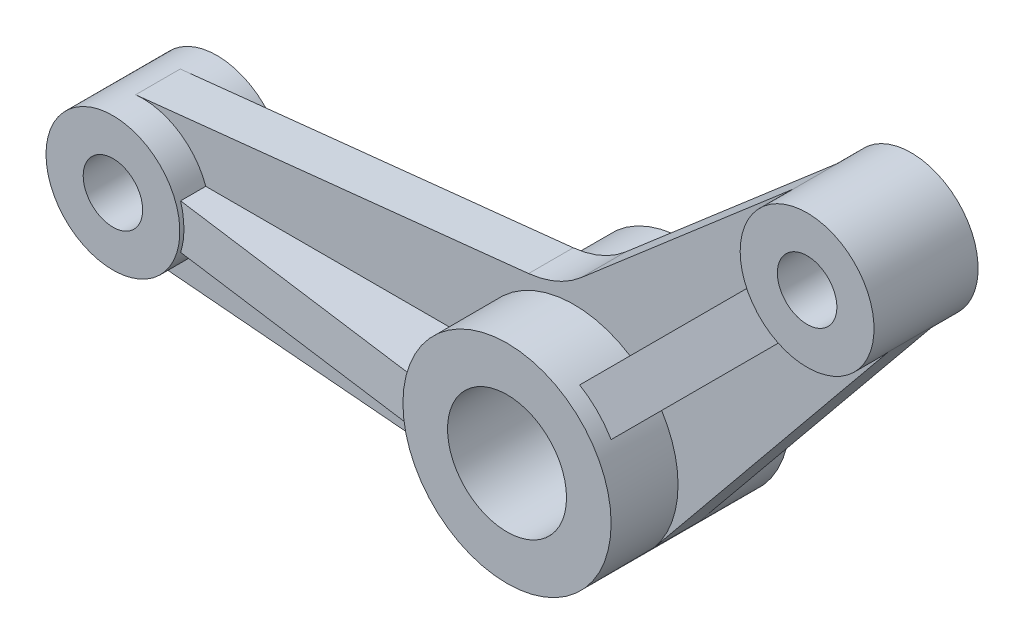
ISO-10303-21;
HEADER;
FILE_DESCRIPTION(('STEP AP214'),'2;1');
FILE_NAME('part.step','',(''),(''),'','','');
FILE_SCHEMA(('AUTOMOTIVE_DESIGN { 1 0 10303 214 1 1 1 1 }'));
ENDSEC;
DATA;
#1=APPLICATION_CONTEXT('core data for automotive mechanical design processes');
#2=APPLICATION_PROTOCOL_DEFINITION('international standard','automotive_design',2000,#1);
#3=PRODUCT_CONTEXT('',#1,'mechanical');
#4=PRODUCT('Part','Part','',(#3));
#5=PRODUCT_RELATED_PRODUCT_CATEGORY('part','',(#4));
#6=PRODUCT_DEFINITION_FORMATION('','',#4);
#7=PRODUCT_DEFINITION_CONTEXT('part definition',#1,'design');
#8=PRODUCT_DEFINITION('design','',#6,#7);
#9=PRODUCT_DEFINITION_SHAPE('','',#8);
#10=(LENGTH_UNIT() NAMED_UNIT(*) SI_UNIT(.MILLI.,.METRE.));
#11=(NAMED_UNIT(*) PLANE_ANGLE_UNIT() SI_UNIT($,.RADIAN.));
#12=(NAMED_UNIT(*) SI_UNIT($,.STERADIAN.) SOLID_ANGLE_UNIT());
#13=UNCERTAINTY_MEASURE_WITH_UNIT(LENGTH_MEASURE(1.E-05),#10,'distance_accuracy_value','');
#14=(GEOMETRIC_REPRESENTATION_CONTEXT(3) GLOBAL_UNCERTAINTY_ASSIGNED_CONTEXT((#13)) GLOBAL_UNIT_ASSIGNED_CONTEXT((#10,
#11,#12)) REPRESENTATION_CONTEXT('',''));
#15=CARTESIAN_POINT('',(0.,0.,0.));
#16=DIRECTION('',(0.,0.,1.));
#17=DIRECTION('',(1.,0.,0.));
#18=AXIS2_PLACEMENT_3D('',#15,#16,#17);
#19=CARTESIAN_POINT('',(-29.,0.,-1.5));
#20=DIRECTION('',(0.,0.,1.));
#21=DIRECTION('',(1.,0.,0.));
#22=AXIS2_PLACEMENT_3D('',#19,#20,#21);
#23=PLANE('',#22);
#24=DIRECTION('',(-0.707106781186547,-0.707106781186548,0.));
#25=VECTOR('',#24,1.);
#26=CARTESIAN_POINT('',(-13.4393398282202,-15.5606601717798,-1.5));
#27=LINE('',#26,#25);
#28=CARTESIAN_POINT('',(15.7383297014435,13.6170093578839,-1.5));
#29=VERTEX_POINT('',#28);
#30=CARTESIAN_POINT('',(5.89543007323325,3.77410972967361,-1.5));
#31=VERTEX_POINT('',#30);
#32=EDGE_CURVE('E210',#29,#31,#27,.T.);
#33=ORIENTED_EDGE('',*,*,#32,.F.);
#34=CARTESIAN_POINT('',(17.6776695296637,17.6776695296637,-1.5));
#35=DIRECTION('',(0.,0.,-1.));
#36=DIRECTION('',(1.,0.,0.));
#37=AXIS2_PLACEMENT_3D('',#34,#35,#36);
#38=CIRCLE('',#37,4.5);
#39=CARTESIAN_POINT('',(21.1618982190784,14.8298369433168,-1.5));
#40=VERTEX_POINT('',#39);
#41=EDGE_CURVE('E323',#40,#29,#38,.T.);
#42=ORIENTED_EDGE('',*,*,#41,.F.);
#43=DIRECTION('',(0.63285168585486,0.774273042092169,0.));
#44=VECTOR('',#43,1.);
#45=CARTESIAN_POINT('',(5.41991129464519,-4.42996180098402,-1.5));
#46=LINE('',#45,#44);
#47=CARTESIAN_POINT('',(5.41991129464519,-4.42996180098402,-1.5));
#48=VERTEX_POINT('',#47);
#49=EDGE_CURVE('E318',#48,#40,#46,.T.);
#50=ORIENTED_EDGE('',*,*,#49,.F.);
#51=CARTESIAN_POINT('',(0.,0.,-1.5));
#52=DIRECTION('',(0.,0.,-1.));
#53=DIRECTION('',(1.,0.,0.));
#54=AXIS2_PLACEMENT_3D('',#51,#52,#53);
#55=CIRCLE('',#54,7.);
#56=EDGE_CURVE('E315',#31,#48,#55,.T.);
#57=ORIENTED_EDGE('',*,*,#56,.F.);
#58=EDGE_LOOP('',(#33,#42,#50,#57));
#59=FACE_BOUND('',#58,.T.);
#60=ADVANCED_FACE('F31',(#59),#23,.F.);
#61=CARTESIAN_POINT('',(-29.,0.,1.5));
#62=DIRECTION('',(0.,0.,1.));
#63=DIRECTION('',(1.,0.,0.));
#64=AXIS2_PLACEMENT_3D('',#61,#62,#63);
#65=PLANE('',#64);
#66=CARTESIAN_POINT('',(17.6776695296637,17.6776695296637,1.5));
#67=DIRECTION('',(0.,0.,-1.));
#68=DIRECTION('',(1.,0.,0.));
#69=AXIS2_PLACEMENT_3D('',#66,#67,#68);
#70=CIRCLE('',#69,4.5);
#71=CARTESIAN_POINT('',(21.1618982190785,14.8298369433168,1.5));
#72=VERTEX_POINT('',#71);
#73=CARTESIAN_POINT('',(15.7383297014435,13.6170093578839,1.5));
#74=VERTEX_POINT('',#73);
#75=EDGE_CURVE('E348',#72,#74,#70,.T.);
#76=ORIENTED_EDGE('',*,*,#75,.T.);
#77=DIRECTION('',(-0.707106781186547,-0.707106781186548,0.));
#78=VECTOR('',#77,1.);
#79=CARTESIAN_POINT('',(-13.4393398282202,-15.5606601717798,1.5));
#80=LINE('',#79,#78);
#81=CARTESIAN_POINT('',(5.89543007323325,3.77410972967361,1.5));
#82=VERTEX_POINT('',#81);
#83=EDGE_CURVE('E233',#74,#82,#80,.T.);
#84=ORIENTED_EDGE('',*,*,#83,.T.);
#85=CARTESIAN_POINT('',(0.,0.,1.5));
#86=DIRECTION('',(0.,0.,-1.));
#87=DIRECTION('',(1.,0.,0.));
#88=AXIS2_PLACEMENT_3D('',#85,#86,#87);
#89=CIRCLE('',#88,7.);
#90=CARTESIAN_POINT('',(5.41991129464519,-4.42996180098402,1.5));
#91=VERTEX_POINT('',#90);
#92=EDGE_CURVE('E340',#82,#91,#89,.T.);
#93=ORIENTED_EDGE('',*,*,#92,.T.);
#94=DIRECTION('',(0.63285168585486,0.774273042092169,0.));
#95=VECTOR('',#94,1.);
#96=CARTESIAN_POINT('',(5.41991129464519,-4.42996180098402,1.5));
#97=LINE('',#96,#95);
#98=EDGE_CURVE('E343',#91,#72,#97,.T.);
#99=ORIENTED_EDGE('',*,*,#98,.T.);
#100=EDGE_LOOP('',(#76,#84,#93,#99));
#101=FACE_BOUND('',#100,.T.);
#102=ADVANCED_FACE('F446',(#101),#65,.T.);
#103=DIRECTION('',(-1.,0.,0.));
#104=VECTOR('',#103,1.);
#105=CARTESIAN_POINT('',(-29.,-1.5,-1.5));
#106=LINE('',#105,#104);
#107=CARTESIAN_POINT('',(-6.83739716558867,-1.5,-1.5));
#108=VERTEX_POINT('',#107);
#109=CARTESIAN_POINT('',(-24.7573593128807,-1.5,-1.5));
#110=VERTEX_POINT('',#109);
#111=EDGE_CURVE('E267',#108,#110,#106,.T.);
#112=ORIENTED_EDGE('',*,*,#111,.F.);
#113=CARTESIAN_POINT('',(-0.603448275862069,-6.97394079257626,-1.5));
#114=VERTEX_POINT('',#113);
#115=EDGE_CURVE('E316',#114,#108,#55,.T.);
#116=ORIENTED_EDGE('',*,*,#115,.F.);
#117=DIRECTION('',(0.996277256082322,-0.0862068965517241,0.));
#118=VECTOR('',#117,1.);
#119=CARTESIAN_POINT('',(-29.3879310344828,-4.48324765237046,-1.5));
#120=LINE('',#119,#118);
#121=CARTESIAN_POINT('',(-29.3879310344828,-4.48324765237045,-1.5));
#122=VERTEX_POINT('',#121);
#123=EDGE_CURVE('E312',#122,#114,#120,.T.);
#124=ORIENTED_EDGE('',*,*,#123,.F.);
#125=CARTESIAN_POINT('',(-29.,0.,-1.5));
#126=DIRECTION('',(0.,0.,-1.));
#127=DIRECTION('',(1.,0.,0.));
#128=AXIS2_PLACEMENT_3D('',#125,#126,#127);
#129=CIRCLE('',#128,4.5);
#130=EDGE_CURVE('E313',#110,#122,#129,.T.);
#131=ORIENTED_EDGE('',*,*,#130,.F.);
#132=EDGE_LOOP('',(#112,#116,#124,#131));
#133=FACE_BOUND('',#132,.T.);
#134=ADVANCED_FACE('F419',(#133),#23,.F.);
#135=DIRECTION('',(0.996277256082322,-0.0862068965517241,0.));
#136=VECTOR('',#135,1.);
#137=CARTESIAN_POINT('',(-29.3879310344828,-4.48324765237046,1.5));
#138=LINE('',#137,#136);
#139=CARTESIAN_POINT('',(-29.3879310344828,-4.48324765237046,1.5));
#140=VERTEX_POINT('',#139);
#141=CARTESIAN_POINT('',(-0.603448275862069,-6.97394079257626,1.5));
#142=VERTEX_POINT('',#141);
#143=EDGE_CURVE('E338',#140,#142,#138,.T.);
#144=ORIENTED_EDGE('',*,*,#143,.T.);
#145=CARTESIAN_POINT('',(-6.83739716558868,-1.5,1.5));
#146=VERTEX_POINT('',#145);
#147=EDGE_CURVE('E341',#142,#146,#89,.T.);
#148=ORIENTED_EDGE('',*,*,#147,.T.);
#149=DIRECTION('',(-1.,0.,0.));
#150=VECTOR('',#149,1.);
#151=CARTESIAN_POINT('',(-29.,-1.5,1.5));
#152=LINE('',#151,#150);
#153=CARTESIAN_POINT('',(-24.7573593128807,-1.5,1.5));
#154=VERTEX_POINT('',#153);
#155=EDGE_CURVE('E259',#146,#154,#152,.T.);
#156=ORIENTED_EDGE('',*,*,#155,.T.);
#157=CARTESIAN_POINT('',(-29.,0.,1.5));
#158=DIRECTION('',(0.,0.,-1.));
#159=DIRECTION('',(1.,0.,0.));
#160=AXIS2_PLACEMENT_3D('',#157,#158,#159);
#161=CIRCLE('',#160,4.5);
#162=EDGE_CURVE('E304',#154,#140,#161,.T.);
#163=ORIENTED_EDGE('',*,*,#162,.T.);
#164=EDGE_LOOP('',(#144,#148,#156,#163));
#165=FACE_BOUND('',#164,.T.);
#166=ADVANCED_FACE('F429',(#165),#65,.T.);
#167=CARTESIAN_POINT('',(-29.,0.,3.5));
#168=DIRECTION('',(0.,0.,-1.));
#169=DIRECTION('',(-1.,0.,0.));
#170=AXIS2_PLACEMENT_3D('',#167,#168,#169);
#171=CYLINDRICAL_SURFACE('',#170,4.5);
#172=DIRECTION('',(0.,0.,-1.));
#173=VECTOR('',#172,1.);
#174=CARTESIAN_POINT('',(-24.7573593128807,1.5,3.5));
#175=LINE('',#174,#173);
#176=CARTESIAN_POINT('',(-24.7573593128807,1.5,-3.19129555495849));
#177=VERTEX_POINT('',#176);
#178=CARTESIAN_POINT('',(-24.7573593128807,1.5,-1.5));
#179=VERTEX_POINT('',#178);
#180=EDGE_CURVE('E278',#177,#179,#175,.F.);
#181=ORIENTED_EDGE('',*,*,#180,.F.);
#182=CARTESIAN_POINT('',(-29.,0.,-2.62216082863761));
#183=DIRECTION('',(0.132955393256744,0.,0.991122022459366));
#184=DIRECTION('',(0.991122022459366,0.,-0.132955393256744));
#185=AXIS2_PLACEMENT_3D('',#182,#183,#184);
#186=ELLIPSE('',#185,4.54030875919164,4.5);
#187=CARTESIAN_POINT('',(-24.7573593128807,-1.5,-3.19129555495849));
#188=VERTEX_POINT('',#187);
#189=EDGE_CURVE('E280',#177,#188,#186,.F.);
#190=ORIENTED_EDGE('',*,*,#189,.T.);
#191=DIRECTION('',(0.,0.,-1.));
#192=VECTOR('',#191,1.);
#193=CARTESIAN_POINT('',(-24.7573593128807,-1.5,3.5));
#194=LINE('',#193,#192);
#195=EDGE_CURVE('E268',#188,#110,#194,.F.);
#196=ORIENTED_EDGE('',*,*,#195,.T.);
#197=ORIENTED_EDGE('',*,*,#130,.T.);
#198=DIRECTION('',(0.,0.,1.));
#199=VECTOR('',#198,1.);
#200=CARTESIAN_POINT('',(-29.3879310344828,-4.48324765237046,-1.5));
#201=LINE('',#200,#199);
#202=EDGE_CURVE('E334',#122,#140,#201,.T.);
#203=ORIENTED_EDGE('',*,*,#202,.T.);
#204=ORIENTED_EDGE('',*,*,#162,.F.);
#205=CARTESIAN_POINT('',(-24.7573593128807,-1.5,3.19129555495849));
#206=VERTEX_POINT('',#205);
#207=EDGE_CURVE('E265',#154,#206,#194,.F.);
#208=ORIENTED_EDGE('',*,*,#207,.T.);
#209=CARTESIAN_POINT('',(-29.,0.,2.62216082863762));
#210=DIRECTION('',(0.132955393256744,0.,-0.991122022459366));
#211=DIRECTION('',(-0.991122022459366,0.,-0.132955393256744));
#212=AXIS2_PLACEMENT_3D('',#209,#210,#211);
#213=ELLIPSE('',#212,4.54030875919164,4.5);
#214=CARTESIAN_POINT('',(-24.7573593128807,1.5,3.19129555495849));
#215=VERTEX_POINT('',#214);
#216=EDGE_CURVE('E282',#206,#215,#213,.F.);
#217=ORIENTED_EDGE('',*,*,#216,.T.);
#218=CARTESIAN_POINT('',(-24.7573593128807,1.5,1.5));
#219=VERTEX_POINT('',#218);
#220=EDGE_CURVE('E274',#219,#215,#175,.F.);
#221=ORIENTED_EDGE('',*,*,#220,.F.);
#222=CARTESIAN_POINT('',(-29.4743823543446,4.47492585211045,1.5));
#223=VERTEX_POINT('',#222);
#224=EDGE_CURVE('E335',#223,#219,#161,.T.);
#225=ORIENTED_EDGE('',*,*,#224,.F.);
#226=DIRECTION('',(0.,0.,1.));
#227=VECTOR('',#226,1.);
#228=CARTESIAN_POINT('',(-29.4743823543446,4.47492585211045,-1.5));
#229=LINE('',#228,#227);
#230=CARTESIAN_POINT('',(-29.4743823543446,4.47492585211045,-1.5));
#231=VERTEX_POINT('',#230);
#232=EDGE_CURVE('E360',#231,#223,#229,.T.);
#233=ORIENTED_EDGE('',*,*,#232,.F.);
#234=EDGE_CURVE('E309',#231,#179,#129,.T.);
#235=ORIENTED_EDGE('',*,*,#234,.T.);
#236=EDGE_LOOP('',(#181,#190,#196,#197,#203,#204,#208,#217,#221,#225,#233,#235));
#237=FACE_BOUND('',#236,.T.);
#238=CARTESIAN_POINT('',(-29.,0.,-3.5));
#239=DIRECTION('',(0.,0.,-1.));
#240=DIRECTION('',(-1.,0.,0.));
#241=AXIS2_PLACEMENT_3D('',#238,#239,#240);
#242=CIRCLE('',#241,4.5);
#243=CARTESIAN_POINT('',(-33.5,0.,-3.5));
#244=VERTEX_POINT('',#243);
#245=EDGE_CURVE('E363',#244,#244,#242,.T.);
#246=ORIENTED_EDGE('',*,*,#245,.F.);
#247=EDGE_LOOP('',(#246));
#248=FACE_BOUND('',#247,.T.);
#249=CARTESIAN_POINT('',(-29.,0.,3.5));
#250=DIRECTION('',(0.,0.,-1.));
#251=DIRECTION('',(-1.,0.,0.));
#252=AXIS2_PLACEMENT_3D('',#249,#250,#251);
#253=CIRCLE('',#252,4.5);
#254=CARTESIAN_POINT('',(-33.5,0.,3.5));
#255=VERTEX_POINT('',#254);
#256=EDGE_CURVE('E382',#255,#255,#253,.T.);
#257=ORIENTED_EDGE('',*,*,#256,.T.);
#258=EDGE_LOOP('',(#257));
#259=FACE_BOUND('',#258,.T.);
#260=ADVANCED_FACE('F33',(#237,#248,#259),#171,.T.);
#261=CARTESIAN_POINT('',(-29.,0.,3.5));
#262=DIRECTION('',(0.,0.,-1.));
#263=DIRECTION('',(-1.,0.,0.));
#264=AXIS2_PLACEMENT_3D('',#261,#262,#263);
#265=CYLINDRICAL_SURFACE('',#264,2.);
#266=CARTESIAN_POINT('',(-29.,0.,3.5));
#267=DIRECTION('',(0.,0.,-1.));
#268=DIRECTION('',(-1.,0.,0.));
#269=AXIS2_PLACEMENT_3D('',#266,#267,#268);
#270=CIRCLE('',#269,2.);
#271=CARTESIAN_POINT('',(-31.,0.,3.5));
#272=VERTEX_POINT('',#271);
#273=EDGE_CURVE('E385',#272,#272,#270,.T.);
#274=ORIENTED_EDGE('',*,*,#273,.F.);
#275=EDGE_LOOP('',(#274));
#276=FACE_BOUND('',#275,.T.);
#277=CARTESIAN_POINT('',(-29.,0.,-3.5));
#278=DIRECTION('',(0.,0.,-1.));
#279=DIRECTION('',(-1.,0.,0.));
#280=AXIS2_PLACEMENT_3D('',#277,#278,#279);
#281=CIRCLE('',#280,2.);
#282=CARTESIAN_POINT('',(-31.,0.,-3.5));
#283=VERTEX_POINT('',#282);
#284=EDGE_CURVE('E386',#283,#283,#281,.T.);
#285=ORIENTED_EDGE('',*,*,#284,.T.);
#286=EDGE_LOOP('',(#285));
#287=FACE_BOUND('',#286,.T.);
#288=ADVANCED_FACE('F517',(#276,#287),#265,.F.);
#289=CARTESIAN_POINT('',(-53.8242386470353,8.83883476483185,3.5));
#290=DIRECTION('',(0.,0.,-1.));
#291=DIRECTION('',(-1.,0.,0.));
#292=AXIS2_PLACEMENT_3D('',#289,#290,#291);
#293=PLANE('',#292);
#294=ORIENTED_EDGE('',*,*,#256,.F.);
#295=EDGE_LOOP('',(#294));
#296=FACE_BOUND('',#295,.T.);
#297=ORIENTED_EDGE('',*,*,#273,.T.);
#298=EDGE_LOOP('',(#297));
#299=FACE_BOUND('',#298,.T.);
#300=ADVANCED_FACE('F513',(#296,#299),#293,.F.);
#301=CARTESIAN_POINT('',(-53.8242386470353,8.83883476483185,-3.5));
#302=DIRECTION('',(0.,0.,-1.));
#303=DIRECTION('',(-1.,0.,0.));
#304=AXIS2_PLACEMENT_3D('',#301,#302,#303);
#305=PLANE('',#304);
#306=ORIENTED_EDGE('',*,*,#245,.T.);
#307=EDGE_LOOP('',(#306));
#308=FACE_BOUND('',#307,.T.);
#309=ORIENTED_EDGE('',*,*,#284,.F.);
#310=EDGE_LOOP('',(#309));
#311=FACE_BOUND('',#310,.T.);
#312=ADVANCED_FACE('F516',(#308,#311),#305,.T.);
#313=CARTESIAN_POINT('',(-29.4743823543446,4.47492585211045,-1.5));
#314=DIRECTION('',(-0.105418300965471,0.994427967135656,0.));
#315=DIRECTION('',(-0.994427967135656,-0.105418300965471,0.));
#316=AXIS2_PLACEMENT_3D('',#313,#314,#315);
#317=PLANE('',#316);
#318=DIRECTION('',(-0.994427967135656,-0.105418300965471,0.));
#319=VECTOR('',#318,1.);
#320=CARTESIAN_POINT('',(-29.4743823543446,4.47492585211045,1.5));
#321=LINE('',#320,#319);
#322=CARTESIAN_POINT('',(-3.04866793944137,7.27628905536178,1.5));
#323=VERTEX_POINT('',#322);
#324=EDGE_CURVE('E357',#323,#223,#321,.T.);
#325=ORIENTED_EDGE('',*,*,#324,.F.);
#326=DIRECTION('',(0.,0.,1.));
#327=VECTOR('',#326,1.);
#328=CARTESIAN_POINT('',(-3.04866793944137,7.27628905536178,-1.5));
#329=LINE('',#328,#327);
#330=CARTESIAN_POINT('',(-3.04866793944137,7.27628905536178,-1.5));
#331=VERTEX_POINT('',#330);
#332=EDGE_CURVE('E364',#331,#323,#329,.T.);
#333=ORIENTED_EDGE('',*,*,#332,.F.);
#334=DIRECTION('',(-0.994427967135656,-0.105418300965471,0.));
#335=VECTOR('',#334,1.);
#336=CARTESIAN_POINT('',(-29.4743823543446,4.47492585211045,-1.5));
#337=LINE('',#336,#335);
#338=EDGE_CURVE('E331',#331,#231,#337,.T.);
#339=ORIENTED_EDGE('',*,*,#338,.T.);
#340=ORIENTED_EDGE('',*,*,#232,.T.);
#341=EDGE_LOOP('',(#325,#333,#339,#340));
#342=FACE_BOUND('',#341,.T.);
#343=ADVANCED_FACE('F520',(#342),#317,.T.);
#344=CARTESIAN_POINT('',(-3.72875501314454,13.6916609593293,-1.5));
#345=DIRECTION('',(0.,0.,1.));
#346=DIRECTION('',(1.,0.,0.));
#347=AXIS2_PLACEMENT_3D('',#344,#345,#346);
#348=CYLINDRICAL_SURFACE('',#347,6.45131886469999);
#349=CARTESIAN_POINT('',(-3.72875501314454,13.6916609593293,1.5));
#350=DIRECTION('',(0.,0.,-1.));
#351=DIRECTION('',(1.,0.,0.));
#352=AXIS2_PLACEMENT_3D('',#349,#350,#351);
#353=CIRCLE('',#352,6.45131886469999);
#354=CARTESIAN_POINT('',(0.48181597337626,8.80385909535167,1.5));
#355=VERTEX_POINT('',#354);
#356=EDGE_CURVE('E354',#355,#323,#353,.T.);
#357=ORIENTED_EDGE('',*,*,#356,.F.);
#358=DIRECTION('',(0.,0.,1.));
#359=VECTOR('',#358,1.);
#360=CARTESIAN_POINT('',(0.48181597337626,8.80385909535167,-1.5));
#361=LINE('',#360,#359);
#362=CARTESIAN_POINT('',(0.48181597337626,8.80385909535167,-1.5));
#363=VERTEX_POINT('',#362);
#364=EDGE_CURVE('E366',#363,#355,#361,.T.);
#365=ORIENTED_EDGE('',*,*,#364,.F.);
#366=CARTESIAN_POINT('',(-3.72875501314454,13.6916609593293,-1.5));
#367=DIRECTION('',(0.,0.,-1.));
#368=DIRECTION('',(1.,0.,0.));
#369=AXIS2_PLACEMENT_3D('',#366,#367,#368);
#370=CIRCLE('',#369,6.45131886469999);
#371=EDGE_CURVE('E328',#363,#331,#370,.T.);
#372=ORIENTED_EDGE('',*,*,#371,.T.);
#373=ORIENTED_EDGE('',*,*,#332,.T.);
#374=EDGE_LOOP('',(#357,#365,#372,#373));
#375=FACE_BOUND('',#374,.T.);
#376=ADVANCED_FACE('F540',(#375),#348,.F.);
#377=CARTESIAN_POINT('',(14.7406624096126,21.0870667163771,-1.5));
#378=DIRECTION('',(-0.652668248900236,0.757643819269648,0.));
#379=DIRECTION('',(-0.757643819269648,-0.652668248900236,0.));
#380=AXIS2_PLACEMENT_3D('',#377,#378,#379);
#381=PLANE('',#380);
#382=DIRECTION('',(-0.757643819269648,-0.652668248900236,0.));
#383=VECTOR('',#382,1.);
#384=CARTESIAN_POINT('',(14.7406624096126,21.0870667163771,1.5));
#385=LINE('',#384,#383);
#386=CARTESIAN_POINT('',(14.7406624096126,21.0870667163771,1.5));
#387=VERTEX_POINT('',#386);
#388=EDGE_CURVE('E351',#387,#355,#385,.T.);
#389=ORIENTED_EDGE('',*,*,#388,.F.);
#390=DIRECTION('',(0.,0.,1.));
#391=VECTOR('',#390,1.);
#392=CARTESIAN_POINT('',(14.7406624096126,21.0870667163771,-1.5));
#393=LINE('',#392,#391);
#394=CARTESIAN_POINT('',(14.7406624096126,21.0870667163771,-1.5));
#395=VERTEX_POINT('',#394);
#396=EDGE_CURVE('E368',#395,#387,#393,.T.);
#397=ORIENTED_EDGE('',*,*,#396,.F.);
#398=DIRECTION('',(-0.757643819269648,-0.652668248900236,0.));
#399=VECTOR('',#398,1.);
#400=CARTESIAN_POINT('',(14.7406624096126,21.0870667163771,-1.5));
#401=LINE('',#400,#399);
#402=EDGE_CURVE('E325',#395,#363,#401,.T.);
#403=ORIENTED_EDGE('',*,*,#402,.T.);
#404=ORIENTED_EDGE('',*,*,#364,.T.);
#405=EDGE_LOOP('',(#389,#397,#403,#404));
#406=FACE_BOUND('',#405,.T.);
#407=ADVANCED_FACE('F471',(#406),#381,.T.);
#408=CARTESIAN_POINT('',(5.41991129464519,-4.42996180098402,-1.5));
#409=DIRECTION('',(0.774273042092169,-0.63285168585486,0.));
#410=DIRECTION('',(0.63285168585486,0.774273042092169,0.));
#411=AXIS2_PLACEMENT_3D('',#408,#409,#410);
#412=PLANE('',#411);
#413=ORIENTED_EDGE('',*,*,#98,.F.);
#414=DIRECTION('',(0.,0.,1.));
#415=VECTOR('',#414,1.);
#416=CARTESIAN_POINT('',(5.41991129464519,-4.42996180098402,-1.5));
#417=LINE('',#416,#415);
#418=EDGE_CURVE('E374',#48,#91,#417,.T.);
#419=ORIENTED_EDGE('',*,*,#418,.F.);
#420=ORIENTED_EDGE('',*,*,#49,.T.);
#421=DIRECTION('',(0.,0.,1.));
#422=VECTOR('',#421,1.);
#423=CARTESIAN_POINT('',(21.1618982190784,14.8298369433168,-1.5));
#424=LINE('',#423,#422);
#425=EDGE_CURVE('E371',#40,#72,#424,.T.);
#426=ORIENTED_EDGE('',*,*,#425,.T.);
#427=EDGE_LOOP('',(#413,#419,#420,#426));
#428=FACE_BOUND('',#427,.T.);
#429=ADVANCED_FACE('F452',(#428),#412,.T.);
#430=CARTESIAN_POINT('',(-29.3879310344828,-4.48324765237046,-1.5));
#431=DIRECTION('',(-0.0862068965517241,-0.996277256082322,0.));
#432=DIRECTION('',(0.996277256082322,-0.0862068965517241,0.));
#433=AXIS2_PLACEMENT_3D('',#430,#431,#432);
#434=PLANE('',#433);
#435=ORIENTED_EDGE('',*,*,#123,.T.);
#436=DIRECTION('',(0.,0.,1.));
#437=VECTOR('',#436,1.);
#438=CARTESIAN_POINT('',(-0.603448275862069,-6.97394079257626,-1.5));
#439=LINE('',#438,#437);
#440=EDGE_CURVE('E377',#114,#142,#439,.T.);
#441=ORIENTED_EDGE('',*,*,#440,.T.);
#442=ORIENTED_EDGE('',*,*,#143,.F.);
#443=ORIENTED_EDGE('',*,*,#202,.F.);
#444=EDGE_LOOP('',(#435,#441,#442,#443));
#445=FACE_BOUND('',#444,.T.);
#446=ADVANCED_FACE('F423',(#445),#434,.T.);
#447=CARTESIAN_POINT('',(13.6170093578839,15.7383297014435,-1.5));
#448=VERTEX_POINT('',#447);
#449=EDGE_CURVE('E322',#448,#395,#38,.T.);
#450=ORIENTED_EDGE('',*,*,#449,.F.);
#451=DIRECTION('',(-0.707106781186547,-0.707106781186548,0.));
#452=VECTOR('',#451,1.);
#453=CARTESIAN_POINT('',(-15.5606601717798,-13.4393398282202,-1.5));
#454=LINE('',#453,#452);
#455=CARTESIAN_POINT('',(3.77410972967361,5.89543007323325,-1.5));
#456=VERTEX_POINT('',#455);
#457=EDGE_CURVE('E220',#448,#456,#454,.T.);
#458=ORIENTED_EDGE('',*,*,#457,.T.);
#459=CARTESIAN_POINT('',(-6.83739716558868,1.5,-1.5));
#460=VERTEX_POINT('',#459);
#461=EDGE_CURVE('E319',#460,#456,#55,.T.);
#462=ORIENTED_EDGE('',*,*,#461,.F.);
#463=DIRECTION('',(-1.,0.,0.));
#464=VECTOR('',#463,1.);
#465=CARTESIAN_POINT('',(-29.,1.5,-1.5));
#466=LINE('',#465,#464);
#467=EDGE_CURVE('E277',#460,#179,#466,.T.);
#468=ORIENTED_EDGE('',*,*,#467,.T.);
#469=ORIENTED_EDGE('',*,*,#234,.F.);
#470=ORIENTED_EDGE('',*,*,#338,.F.);
#471=ORIENTED_EDGE('',*,*,#371,.F.);
#472=ORIENTED_EDGE('',*,*,#402,.F.);
#473=EDGE_LOOP('',(#450,#458,#462,#468,#469,#470,#471,#472));
#474=FACE_BOUND('',#473,.T.);
#475=ADVANCED_FACE('F466',(#474),#23,.F.);
#476=DIRECTION('',(-0.707106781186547,-0.707106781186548,0.));
#477=VECTOR('',#476,1.);
#478=CARTESIAN_POINT('',(-15.5606601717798,-13.4393398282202,1.5));
#479=LINE('',#478,#477);
#480=CARTESIAN_POINT('',(13.6170093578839,15.7383297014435,1.5));
#481=VERTEX_POINT('',#480);
#482=CARTESIAN_POINT('',(3.77410972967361,5.89543007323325,1.5));
#483=VERTEX_POINT('',#482);
#484=EDGE_CURVE('E241',#481,#483,#479,.T.);
#485=ORIENTED_EDGE('',*,*,#484,.F.);
#486=EDGE_CURVE('E347',#481,#387,#70,.T.);
#487=ORIENTED_EDGE('',*,*,#486,.T.);
#488=ORIENTED_EDGE('',*,*,#388,.T.);
#489=ORIENTED_EDGE('',*,*,#356,.T.);
#490=ORIENTED_EDGE('',*,*,#324,.T.);
#491=ORIENTED_EDGE('',*,*,#224,.T.);
#492=DIRECTION('',(-1.,0.,0.));
#493=VECTOR('',#492,1.);
#494=CARTESIAN_POINT('',(-29.,1.5,1.5));
#495=LINE('',#494,#493);
#496=CARTESIAN_POINT('',(-6.83739716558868,1.5,1.5));
#497=VERTEX_POINT('',#496);
#498=EDGE_CURVE('E271',#497,#219,#495,.T.);
#499=ORIENTED_EDGE('',*,*,#498,.F.);
#500=EDGE_CURVE('E344',#497,#483,#89,.T.);
#501=ORIENTED_EDGE('',*,*,#500,.T.);
#502=EDGE_LOOP('',(#485,#487,#488,#489,#490,#491,#499,#501));
#503=FACE_BOUND('',#502,.T.);
#504=ADVANCED_FACE('F443',(#503),#65,.T.);
#505=CARTESIAN_POINT('',(17.6776695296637,17.6776695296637,3.5));
#506=DIRECTION('',(0.,0.,-1.));
#507=DIRECTION('',(-1.,0.,0.));
#508=AXIS2_PLACEMENT_3D('',#505,#506,#507);
#509=CYLINDRICAL_SURFACE('',#508,4.5);
#510=CARTESIAN_POINT('',(17.6776695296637,17.6776695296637,3.5));
#511=DIRECTION('',(0.,0.,-1.));
#512=DIRECTION('',(-1.,0.,0.));
#513=AXIS2_PLACEMENT_3D('',#510,#511,#512);
#514=CIRCLE('',#513,4.5);
#515=CARTESIAN_POINT('',(13.1776695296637,17.6776695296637,3.5));
#516=VERTEX_POINT('',#515);
#517=EDGE_CURVE('E297',#516,#516,#514,.T.);
#518=ORIENTED_EDGE('',*,*,#517,.T.);
#519=EDGE_LOOP('',(#518));
#520=FACE_BOUND('',#519,.T.);
#521=DIRECTION('',(0.,0.,-1.));
#522=VECTOR('',#521,1.);
#523=CARTESIAN_POINT('',(13.6170093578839,15.7383297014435,3.5));
#524=LINE('',#523,#522);
#525=CARTESIAN_POINT('',(13.6170093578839,15.7383297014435,3.15042302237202));
#526=VERTEX_POINT('',#525);
#527=EDGE_CURVE('E242',#526,#481,#524,.T.);
#528=ORIENTED_EDGE('',*,*,#527,.F.);
#529=CARTESIAN_POINT('',(17.6776695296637,17.6776695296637,2.6186821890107));
#530=DIRECTION('',(0.0879355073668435,0.0879355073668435,0.992237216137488));
#531=DIRECTION('',(0.70161766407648,0.70161766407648,-0.124359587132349));
#532=AXIS2_PLACEMENT_3D('',#529,#530,#531);
#533=ELLIPSE('',#532,4.53520582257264,4.5);
#534=CARTESIAN_POINT('',(15.7383297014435,13.6170093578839,3.15042302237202));
#535=VERTEX_POINT('',#534);
#536=EDGE_CURVE('E248',#535,#526,#533,.F.);
#537=ORIENTED_EDGE('',*,*,#536,.F.);
#538=DIRECTION('',(0.,0.,-1.));
#539=VECTOR('',#538,1.);
#540=CARTESIAN_POINT('',(15.7383297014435,13.6170093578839,3.5));
#541=LINE('',#540,#539);
#542=EDGE_CURVE('E234',#535,#74,#541,.T.);
#543=ORIENTED_EDGE('',*,*,#542,.T.);
#544=ORIENTED_EDGE('',*,*,#75,.F.);
#545=ORIENTED_EDGE('',*,*,#425,.F.);
#546=ORIENTED_EDGE('',*,*,#41,.T.);
#547=DIRECTION('',(0.,0.,-1.));
#548=VECTOR('',#547,1.);
#549=CARTESIAN_POINT('',(15.7383297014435,13.6170093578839,3.5));
#550=LINE('',#549,#548);
#551=CARTESIAN_POINT('',(15.7383297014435,13.6170093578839,-3.15042302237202));
#552=VERTEX_POINT('',#551);
#553=EDGE_CURVE('E52',#29,#552,#550,.T.);
#554=ORIENTED_EDGE('',*,*,#553,.T.);
#555=CARTESIAN_POINT('',(17.6776695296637,17.6776695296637,-2.6186821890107));
#556=DIRECTION('',(-0.0879355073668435,-0.0879355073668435,0.992237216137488));
#557=DIRECTION('',(-0.70161766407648,-0.70161766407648,-0.124359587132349));
#558=AXIS2_PLACEMENT_3D('',#555,#556,#557);
#559=ELLIPSE('',#558,4.53520582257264,4.5);
#560=CARTESIAN_POINT('',(13.6170093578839,15.7383297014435,-3.15042302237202));
#561=VERTEX_POINT('',#560);
#562=EDGE_CURVE('E47',#561,#552,#559,.T.);
#563=ORIENTED_EDGE('',*,*,#562,.F.);
#564=DIRECTION('',(0.,0.,-1.));
#565=VECTOR('',#564,1.);
#566=CARTESIAN_POINT('',(13.6170093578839,15.7383297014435,3.5));
#567=LINE('',#566,#565);
#568=EDGE_CURVE('E203',#448,#561,#567,.T.);
#569=ORIENTED_EDGE('',*,*,#568,.F.);
#570=ORIENTED_EDGE('',*,*,#449,.T.);
#571=ORIENTED_EDGE('',*,*,#396,.T.);
#572=ORIENTED_EDGE('',*,*,#486,.F.);
#573=EDGE_LOOP('',(#528,#537,#543,#544,#545,#546,#554,#563,#569,#570,#571,#572));
#574=FACE_BOUND('',#573,.T.);
#575=CARTESIAN_POINT('',(17.6776695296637,17.6776695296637,-3.5));
#576=DIRECTION('',(0.,0.,-1.));
#577=DIRECTION('',(-1.,0.,0.));
#578=AXIS2_PLACEMENT_3D('',#575,#576,#577);
#579=CIRCLE('',#578,4.5);
#580=CARTESIAN_POINT('',(13.1776695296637,17.6776695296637,-3.5));
#581=VERTEX_POINT('',#580);
#582=EDGE_CURVE('E294',#581,#581,#579,.T.);
#583=ORIENTED_EDGE('',*,*,#582,.F.);
#584=EDGE_LOOP('',(#583));
#585=FACE_BOUND('',#584,.T.);
#586=ADVANCED_FACE('F454',(#520,#574,#585),#509,.T.);
#587=CARTESIAN_POINT('',(17.6776695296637,17.6776695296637,3.5));
#588=DIRECTION('',(0.,0.,-1.));
#589=DIRECTION('',(-1.,0.,0.));
#590=AXIS2_PLACEMENT_3D('',#587,#588,#589);
#591=CYLINDRICAL_SURFACE('',#590,2.);
#592=CARTESIAN_POINT('',(17.6776695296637,17.6776695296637,3.5));
#593=DIRECTION('',(0.,0.,-1.));
#594=DIRECTION('',(-1.,0.,0.));
#595=AXIS2_PLACEMENT_3D('',#592,#593,#594);
#596=CIRCLE('',#595,2.);
#597=CARTESIAN_POINT('',(15.6776695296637,17.6776695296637,3.5));
#598=VERTEX_POINT('',#597);
#599=EDGE_CURVE('E300',#598,#598,#596,.T.);
#600=ORIENTED_EDGE('',*,*,#599,.F.);
#601=EDGE_LOOP('',(#600));
#602=FACE_BOUND('',#601,.T.);
#603=CARTESIAN_POINT('',(17.6776695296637,17.6776695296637,-3.5));
#604=DIRECTION('',(0.,0.,-1.));
#605=DIRECTION('',(-1.,0.,0.));
#606=AXIS2_PLACEMENT_3D('',#603,#604,#605);
#607=CIRCLE('',#606,2.);
#608=CARTESIAN_POINT('',(15.6776695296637,17.6776695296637,-3.5));
#609=VERTEX_POINT('',#608);
#610=EDGE_CURVE('E301',#609,#609,#607,.T.);
#611=ORIENTED_EDGE('',*,*,#610,.T.);
#612=EDGE_LOOP('',(#611));
#613=FACE_BOUND('',#612,.T.);
#614=ADVANCED_FACE('F696',(#602,#613),#591,.F.);
#615=CARTESIAN_POINT('',(-53.8242386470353,8.83883476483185,3.5));
#616=DIRECTION('',(0.,0.,-1.));
#617=DIRECTION('',(-1.,0.,0.));
#618=AXIS2_PLACEMENT_3D('',#615,#616,#617);
#619=PLANE('',#618);
#620=ORIENTED_EDGE('',*,*,#599,.T.);
#621=EDGE_LOOP('',(#620));
#622=FACE_BOUND('',#621,.T.);
#623=ORIENTED_EDGE('',*,*,#517,.F.);
#624=EDGE_LOOP('',(#623));
#625=FACE_BOUND('',#624,.T.);
#626=ADVANCED_FACE('F640',(#622,#625),#619,.F.);
#627=CARTESIAN_POINT('',(-53.8242386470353,8.83883476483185,-3.5));
#628=DIRECTION('',(0.,0.,-1.));
#629=DIRECTION('',(-1.,0.,0.));
#630=AXIS2_PLACEMENT_3D('',#627,#628,#629);
#631=PLANE('',#630);
#632=ORIENTED_EDGE('',*,*,#610,.F.);
#633=EDGE_LOOP('',(#632));
#634=FACE_BOUND('',#633,.T.);
#635=ORIENTED_EDGE('',*,*,#582,.T.);
#636=EDGE_LOOP('',(#635));
#637=FACE_BOUND('',#636,.T.);
#638=ADVANCED_FACE('F635',(#634,#637),#631,.T.);
#639=CARTESIAN_POINT('',(0.,0.,6.));
#640=DIRECTION('',(0.,0.,-1.));
#641=DIRECTION('',(-1.,0.,0.));
#642=AXIS2_PLACEMENT_3D('',#639,#640,#641);
#643=CYLINDRICAL_SURFACE('',#642,7.);
#644=CARTESIAN_POINT('',(0.,0.,5.75199509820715));
#645=DIRECTION('',(0.0879355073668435,0.0879355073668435,0.992237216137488));
#646=DIRECTION('',(0.70161766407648,0.70161766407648,-0.124359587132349));
#647=AXIS2_PLACEMENT_3D('',#644,#645,#646);
#648=ELLIPSE('',#647,7.05476461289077,7.);
#649=CARTESIAN_POINT('',(5.89543007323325,3.77410972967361,4.89504690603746));
#650=VERTEX_POINT('',#649);
#651=CARTESIAN_POINT('',(3.77410972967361,5.89543007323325,4.89504690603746));
#652=VERTEX_POINT('',#651);
#653=EDGE_CURVE('E245',#650,#652,#648,.T.);
#654=ORIENTED_EDGE('',*,*,#653,.T.);
#655=DIRECTION('',(0.,0.,-1.));
#656=VECTOR('',#655,1.);
#657=CARTESIAN_POINT('',(3.77410972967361,5.89543007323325,6.));
#658=LINE('',#657,#656);
#659=EDGE_CURVE('E236',#652,#483,#658,.T.);
#660=ORIENTED_EDGE('',*,*,#659,.T.);
#661=ORIENTED_EDGE('',*,*,#500,.F.);
#662=DIRECTION('',(0.,0.,-1.));
#663=VECTOR('',#662,1.);
#664=CARTESIAN_POINT('',(-6.83739716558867,1.5,6.));
#665=LINE('',#664,#663);
#666=CARTESIAN_POINT('',(-6.83739716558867,1.5,5.59519291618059));
#667=VERTEX_POINT('',#666);
#668=EDGE_CURVE('E40',#497,#667,#665,.F.);
#669=ORIENTED_EDGE('',*,*,#668,.T.);
#670=CARTESIAN_POINT('',(0.,0.,6.51240473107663));
#671=DIRECTION('',(0.132955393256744,0.,-0.991122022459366));
#672=DIRECTION('',(-0.991122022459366,0.,-0.132955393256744));
#673=AXIS2_PLACEMENT_3D('',#670,#671,#672);
#674=ELLIPSE('',#673,7.06270251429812,7.);
#675=CARTESIAN_POINT('',(-6.83739716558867,-1.5,5.59519291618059));
#676=VERTEX_POINT('',#675);
#677=EDGE_CURVE('E396',#676,#667,#674,.T.);
#678=ORIENTED_EDGE('',*,*,#677,.F.);
#679=DIRECTION('',(0.,0.,-1.));
#680=VECTOR('',#679,1.);
#681=CARTESIAN_POINT('',(-6.83739716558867,-1.5,6.));
#682=LINE('',#681,#680);
#683=EDGE_CURVE('E389',#146,#676,#682,.F.);
#684=ORIENTED_EDGE('',*,*,#683,.F.);
#685=ORIENTED_EDGE('',*,*,#147,.F.);
#686=ORIENTED_EDGE('',*,*,#440,.F.);
#687=ORIENTED_EDGE('',*,*,#115,.T.);
#688=CARTESIAN_POINT('',(-6.83739716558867,-1.5,-5.59519291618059));
#689=VERTEX_POINT('',#688);
#690=EDGE_CURVE('E397',#689,#108,#682,.F.);
#691=ORIENTED_EDGE('',*,*,#690,.F.);
#692=CARTESIAN_POINT('',(0.,0.,-6.51240473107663));
#693=DIRECTION('',(0.132955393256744,0.,0.991122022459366));
#694=DIRECTION('',(0.991122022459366,0.,-0.132955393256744));
#695=AXIS2_PLACEMENT_3D('',#692,#693,#694);
#696=ELLIPSE('',#695,7.06270251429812,7.);
#697=CARTESIAN_POINT('',(-6.83739716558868,1.5,-5.59519291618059));
#698=VERTEX_POINT('',#697);
#699=EDGE_CURVE('E35',#698,#689,#696,.T.);
#700=ORIENTED_EDGE('',*,*,#699,.F.);
#701=EDGE_CURVE('E11',#698,#460,#665,.F.);
#702=ORIENTED_EDGE('',*,*,#701,.T.);
#703=ORIENTED_EDGE('',*,*,#461,.T.);
#704=DIRECTION('',(0.,0.,-1.));
#705=VECTOR('',#704,1.);
#706=CARTESIAN_POINT('',(3.77410972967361,5.89543007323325,6.));
#707=LINE('',#706,#705);
#708=CARTESIAN_POINT('',(3.77410972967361,5.89543007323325,-4.89504690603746));
#709=VERTEX_POINT('',#708);
#710=EDGE_CURVE('E198',#456,#709,#707,.T.);
#711=ORIENTED_EDGE('',*,*,#710,.T.);
#712=CARTESIAN_POINT('',(0.,0.,-5.75199509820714));
#713=DIRECTION('',(-0.0879355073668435,-0.0879355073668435,0.992237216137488));
#714=DIRECTION('',(-0.70161766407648,-0.70161766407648,-0.124359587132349));
#715=AXIS2_PLACEMENT_3D('',#712,#713,#714);
#716=ELLIPSE('',#715,7.05476461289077,7.);
#717=CARTESIAN_POINT('',(5.89543007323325,3.77410972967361,-4.89504690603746));
#718=VERTEX_POINT('',#717);
#719=EDGE_CURVE('E190',#709,#718,#716,.F.);
#720=ORIENTED_EDGE('',*,*,#719,.T.);
#721=DIRECTION('',(0.,0.,-1.));
#722=VECTOR('',#721,1.);
#723=CARTESIAN_POINT('',(5.89543007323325,3.77410972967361,6.));
#724=LINE('',#723,#722);
#725=EDGE_CURVE('E194',#31,#718,#724,.T.);
#726=ORIENTED_EDGE('',*,*,#725,.F.);
#727=ORIENTED_EDGE('',*,*,#56,.T.);
#728=ORIENTED_EDGE('',*,*,#418,.T.);
#729=ORIENTED_EDGE('',*,*,#92,.F.);
#730=DIRECTION('',(0.,0.,-1.));
#731=VECTOR('',#730,1.);
#732=CARTESIAN_POINT('',(5.89543007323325,3.77410972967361,6.));
#733=LINE('',#732,#731);
#734=EDGE_CURVE('E228',#650,#82,#733,.T.);
#735=ORIENTED_EDGE('',*,*,#734,.F.);
#736=EDGE_LOOP('',(#654,#660,#661,#669,#678,#684,#685,#686,#687,#691,#700,#702,#703,#711,#720,
#726,#727,#728,#729,#735));
#737=FACE_BOUND('',#736,.T.);
#738=CARTESIAN_POINT('',(0.,0.,6.));
#739=DIRECTION('',(0.,0.,1.));
#740=DIRECTION('',(1.,0.,0.));
#741=AXIS2_PLACEMENT_3D('',#738,#739,#740);
#742=CIRCLE('',#741,7.);
#743=CARTESIAN_POINT('',(7.,0.,6.));
#744=VERTEX_POINT('',#743);
#745=EDGE_CURVE('E291',#744,#744,#742,.T.);
#746=ORIENTED_EDGE('',*,*,#745,.F.);
#747=EDGE_LOOP('',(#746));
#748=FACE_BOUND('',#747,.T.);
#749=CARTESIAN_POINT('',(0.,0.,-6.));
#750=DIRECTION('',(0.,0.,1.));
#751=DIRECTION('',(1.,0.,0.));
#752=AXIS2_PLACEMENT_3D('',#749,#750,#751);
#753=CIRCLE('',#752,7.);
#754=CARTESIAN_POINT('',(7.,0.,-6.));
#755=VERTEX_POINT('',#754);
#756=EDGE_CURVE('E288',#755,#755,#753,.T.);
#757=ORIENTED_EDGE('',*,*,#756,.T.);
#758=EDGE_LOOP('',(#757));
#759=FACE_BOUND('',#758,.T.);
#760=ADVANCED_FACE('F192',(#737,#748,#759),#643,.T.);
#761=CARTESIAN_POINT('',(0.,0.,6.));
#762=DIRECTION('',(0.,0.,1.));
#763=DIRECTION('',(1.,0.,0.));
#764=AXIS2_PLACEMENT_3D('',#761,#762,#763);
#765=PLANE('',#764);
#766=CARTESIAN_POINT('',(0.,0.,6.));
#767=DIRECTION('',(0.,0.,1.));
#768=DIRECTION('',(1.,0.,0.));
#769=AXIS2_PLACEMENT_3D('',#766,#767,#768);
#770=CIRCLE('',#769,4.);
#771=CARTESIAN_POINT('',(4.,0.,6.));
#772=VERTEX_POINT('',#771);
#773=EDGE_CURVE('E285',#772,#772,#770,.T.);
#774=ORIENTED_EDGE('',*,*,#773,.F.);
#775=EDGE_LOOP('',(#774));
#776=FACE_BOUND('',#775,.T.);
#777=ORIENTED_EDGE('',*,*,#745,.T.);
#778=EDGE_LOOP('',(#777));
#779=FACE_BOUND('',#778,.T.);
#780=ADVANCED_FACE('F719',(#776,#779),#765,.T.);
#781=CARTESIAN_POINT('',(0.,0.,-6.));
#782=DIRECTION('',(0.,0.,1.));
#783=DIRECTION('',(1.,0.,0.));
#784=AXIS2_PLACEMENT_3D('',#781,#782,#783);
#785=PLANE('',#784);
#786=ORIENTED_EDGE('',*,*,#756,.F.);
#787=EDGE_LOOP('',(#786));
#788=FACE_BOUND('',#787,.T.);
#789=CARTESIAN_POINT('',(0.,0.,-6.));
#790=DIRECTION('',(0.,0.,1.));
#791=DIRECTION('',(1.,0.,0.));
#792=AXIS2_PLACEMENT_3D('',#789,#790,#791);
#793=CIRCLE('',#792,4.);
#794=CARTESIAN_POINT('',(4.,0.,-6.));
#795=VERTEX_POINT('',#794);
#796=EDGE_CURVE('E284',#795,#795,#793,.T.);
#797=ORIENTED_EDGE('',*,*,#796,.T.);
#798=EDGE_LOOP('',(#797));
#799=FACE_BOUND('',#798,.T.);
#800=ADVANCED_FACE('F728',(#788,#799),#785,.F.);
#801=CARTESIAN_POINT('',(0.,0.,6.));
#802=DIRECTION('',(0.,0.,-1.));
#803=DIRECTION('',(-1.,0.,0.));
#804=AXIS2_PLACEMENT_3D('',#801,#802,#803);
#805=CYLINDRICAL_SURFACE('',#804,4.);
#806=ORIENTED_EDGE('',*,*,#773,.T.);
#807=EDGE_LOOP('',(#806));
#808=FACE_BOUND('',#807,.T.);
#809=ORIENTED_EDGE('',*,*,#796,.F.);
#810=EDGE_LOOP('',(#809));
#811=FACE_BOUND('',#810,.T.);
#812=ADVANCED_FACE('F569',(#808,#811),#805,.F.);
#813=CARTESIAN_POINT('',(-25.2893812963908,1.5,3.11992675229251));
#814=DIRECTION('',(0.,1.,0.));
#815=DIRECTION('',(0.,0.,1.));
#816=AXIS2_PLACEMENT_3D('',#813,#814,#815);
#817=PLANE('',#816);
#818=ORIENTED_EDGE('',*,*,#498,.T.);
#819=ORIENTED_EDGE('',*,*,#220,.T.);
#820=DIRECTION('',(0.991122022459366,0.,0.132955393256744));
#821=VECTOR('',#820,1.);
#822=CARTESIAN_POINT('',(-5.99402898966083,1.5,5.70832767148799));
#823=LINE('',#822,#821);
#824=EDGE_CURVE('E252',#215,#667,#823,.T.);
#825=ORIENTED_EDGE('',*,*,#824,.T.);
#826=ORIENTED_EDGE('',*,*,#668,.F.);
#827=EDGE_LOOP('',(#818,#819,#825,#826));
#828=FACE_BOUND('',#827,.T.);
#829=ADVANCED_FACE('F440',(#828),#817,.T.);
#830=CARTESIAN_POINT('',(-25.2893812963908,-1.5,3.11992675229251));
#831=DIRECTION('',(0.,1.,0.));
#832=DIRECTION('',(0.,0.,1.));
#833=AXIS2_PLACEMENT_3D('',#830,#831,#832);
#834=PLANE('',#833);
#835=ORIENTED_EDGE('',*,*,#207,.F.);
#836=ORIENTED_EDGE('',*,*,#155,.F.);
#837=ORIENTED_EDGE('',*,*,#683,.T.);
#838=DIRECTION('',(0.991122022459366,0.,0.132955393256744));
#839=VECTOR('',#838,1.);
#840=CARTESIAN_POINT('',(-5.99402898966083,-1.5,5.70832767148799));
#841=LINE('',#840,#839);
#842=EDGE_CURVE('E251',#206,#676,#841,.T.);
#843=ORIENTED_EDGE('',*,*,#842,.F.);
#844=EDGE_LOOP('',(#835,#836,#837,#843));
#845=FACE_BOUND('',#844,.T.);
#846=ADVANCED_FACE('F435',(#845),#834,.F.);
#847=CARTESIAN_POINT('',(-5.99402898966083,1.5,5.70832767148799));
#848=DIRECTION('',(0.132955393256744,0.,-0.991122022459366));
#849=DIRECTION('',(-0.991122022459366,0.,-0.132955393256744));
#850=AXIS2_PLACEMENT_3D('',#847,#848,#849);
#851=PLANE('',#850);
#852=ORIENTED_EDGE('',*,*,#216,.F.);
#853=ORIENTED_EDGE('',*,*,#842,.T.);
#854=ORIENTED_EDGE('',*,*,#677,.T.);
#855=ORIENTED_EDGE('',*,*,#824,.F.);
#856=EDGE_LOOP('',(#852,#853,#854,#855));
#857=FACE_BOUND('',#856,.T.);
#858=ADVANCED_FACE('F437',(#857),#851,.F.);
#859=CARTESIAN_POINT('',(-25.2893812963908,1.5,-3.1199267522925));
#860=DIRECTION('',(0.132955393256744,0.,0.991122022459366));
#861=DIRECTION('',(0.991122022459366,0.,-0.132955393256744));
#862=AXIS2_PLACEMENT_3D('',#859,#860,#861);
#863=PLANE('',#862);
#864=ORIENTED_EDGE('',*,*,#189,.F.);
#865=DIRECTION('',(-0.991122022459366,0.,0.132955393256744));
#866=VECTOR('',#865,1.);
#867=CARTESIAN_POINT('',(-25.2893812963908,1.5,-3.1199267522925));
#868=LINE('',#867,#866);
#869=EDGE_CURVE('E255',#698,#177,#868,.T.);
#870=ORIENTED_EDGE('',*,*,#869,.F.);
#871=ORIENTED_EDGE('',*,*,#699,.T.);
#872=DIRECTION('',(-0.991122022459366,0.,0.132955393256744));
#873=VECTOR('',#872,1.);
#874=CARTESIAN_POINT('',(-25.2893812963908,-1.5,-3.1199267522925));
#875=LINE('',#874,#873);
#876=EDGE_CURVE('E256',#689,#188,#875,.T.);
#877=ORIENTED_EDGE('',*,*,#876,.T.);
#878=EDGE_LOOP('',(#864,#870,#871,#877));
#879=FACE_BOUND('',#878,.T.);
#880=ADVANCED_FACE('F408',(#879),#863,.F.);
#881=ORIENTED_EDGE('',*,*,#869,.T.);
#882=ORIENTED_EDGE('',*,*,#180,.T.);
#883=ORIENTED_EDGE('',*,*,#467,.F.);
#884=ORIENTED_EDGE('',*,*,#701,.F.);
#885=EDGE_LOOP('',(#881,#882,#883,#884));
#886=FACE_BOUND('',#885,.T.);
#887=ADVANCED_FACE('F571',(#886),#817,.T.);
#888=ORIENTED_EDGE('',*,*,#195,.F.);
#889=ORIENTED_EDGE('',*,*,#876,.F.);
#890=ORIENTED_EDGE('',*,*,#690,.T.);
#891=ORIENTED_EDGE('',*,*,#111,.T.);
#892=EDGE_LOOP('',(#888,#889,#890,#891));
#893=FACE_BOUND('',#892,.T.);
#894=ADVANCED_FACE('F411',(#893),#834,.F.);
#895=CARTESIAN_POINT('',(4.24264068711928,4.24264068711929,5.));
#896=DIRECTION('',(0.0879355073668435,0.0879355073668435,0.992237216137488));
#897=DIRECTION('',(0.701617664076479,0.70161766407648,-0.124359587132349));
#898=AXIS2_PLACEMENT_3D('',#895,#896,#897);
#899=PLANE('',#898);
#900=DIRECTION('',(0.701617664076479,0.70161766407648,-0.124359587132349));
#901=VECTOR('',#900,1.);
#902=CARTESIAN_POINT('',(5.30330085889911,3.18198051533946,5.));
#903=LINE('',#902,#901);
#904=EDGE_CURVE('E224',#650,#535,#903,.T.);
#905=ORIENTED_EDGE('',*,*,#904,.T.);
#906=ORIENTED_EDGE('',*,*,#536,.T.);
#907=DIRECTION('',(0.701617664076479,0.70161766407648,-0.124359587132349));
#908=VECTOR('',#907,1.);
#909=CARTESIAN_POINT('',(3.18198051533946,5.30330085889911,5.));
#910=LINE('',#909,#908);
#911=EDGE_CURVE('E225',#652,#526,#910,.T.);
#912=ORIENTED_EDGE('',*,*,#911,.F.);
#913=ORIENTED_EDGE('',*,*,#653,.F.);
#914=EDGE_LOOP('',(#905,#906,#912,#913));
#915=FACE_BOUND('',#914,.T.);
#916=ADVANCED_FACE('F479',(#915),#899,.T.);
#917=CARTESIAN_POINT('',(-0.0968254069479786,2.02449493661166,0.));
#918=DIRECTION('',(-0.707106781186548,0.707106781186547,0.));
#919=DIRECTION('',(-0.707106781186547,-0.707106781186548,0.));
#920=AXIS2_PLACEMENT_3D('',#917,#918,#919);
#921=PLANE('',#920);
#922=ORIENTED_EDGE('',*,*,#484,.T.);
#923=ORIENTED_EDGE('',*,*,#659,.F.);
#924=ORIENTED_EDGE('',*,*,#911,.T.);
#925=ORIENTED_EDGE('',*,*,#527,.T.);
#926=EDGE_LOOP('',(#922,#923,#924,#925));
#927=FACE_BOUND('',#926,.T.);
#928=ADVANCED_FACE('F475',(#927),#921,.T.);
#929=CARTESIAN_POINT('',(2.02449493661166,-0.096825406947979,0.));
#930=DIRECTION('',(-0.707106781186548,0.707106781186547,0.));
#931=DIRECTION('',(-0.707106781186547,-0.707106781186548,0.));
#932=AXIS2_PLACEMENT_3D('',#929,#930,#931);
#933=PLANE('',#932);
#934=ORIENTED_EDGE('',*,*,#542,.F.);
#935=ORIENTED_EDGE('',*,*,#904,.F.);
#936=ORIENTED_EDGE('',*,*,#734,.T.);
#937=ORIENTED_EDGE('',*,*,#83,.F.);
#938=EDGE_LOOP('',(#934,#935,#936,#937));
#939=FACE_BOUND('',#938,.T.);
#940=ADVANCED_FACE('F483',(#939),#933,.F.);
#941=CARTESIAN_POINT('',(4.24264068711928,4.24264068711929,-5.));
#942=DIRECTION('',(-0.0879355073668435,-0.0879355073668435,0.992237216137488));
#943=DIRECTION('',(0.701617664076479,0.70161766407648,0.124359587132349));
#944=AXIS2_PLACEMENT_3D('',#941,#942,#943);
#945=PLANE('',#944);
#946=DIRECTION('',(0.701617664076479,0.70161766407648,0.124359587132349));
#947=VECTOR('',#946,1.);
#948=CARTESIAN_POINT('',(3.18198051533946,5.30330085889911,-5.));
#949=LINE('',#948,#947);
#950=EDGE_CURVE('E211',#709,#561,#949,.T.);
#951=ORIENTED_EDGE('',*,*,#950,.T.);
#952=ORIENTED_EDGE('',*,*,#562,.T.);
#953=DIRECTION('',(0.701617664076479,0.70161766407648,0.124359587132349));
#954=VECTOR('',#953,1.);
#955=CARTESIAN_POINT('',(5.30330085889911,3.18198051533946,-5.));
#956=LINE('',#955,#954);
#957=EDGE_CURVE('E209',#718,#552,#956,.T.);
#958=ORIENTED_EDGE('',*,*,#957,.F.);
#959=ORIENTED_EDGE('',*,*,#719,.F.);
#960=EDGE_LOOP('',(#951,#952,#958,#959));
#961=FACE_BOUND('',#960,.T.);
#962=ADVANCED_FACE('F213',(#961),#945,.F.);
#963=CARTESIAN_POINT('',(-0.0968254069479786,2.02449493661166,0.));
#964=DIRECTION('',(-0.707106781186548,0.707106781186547,0.));
#965=DIRECTION('',(-0.707106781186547,-0.707106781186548,0.));
#966=AXIS2_PLACEMENT_3D('',#963,#964,#965);
#967=PLANE('',#966);
#968=ORIENTED_EDGE('',*,*,#710,.F.);
#969=ORIENTED_EDGE('',*,*,#457,.F.);
#970=ORIENTED_EDGE('',*,*,#568,.T.);
#971=ORIENTED_EDGE('',*,*,#950,.F.);
#972=EDGE_LOOP('',(#968,#969,#970,#971));
#973=FACE_BOUND('',#972,.T.);
#974=ADVANCED_FACE('F462',(#973),#967,.T.);
#975=CARTESIAN_POINT('',(2.02449493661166,-0.096825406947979,0.));
#976=DIRECTION('',(-0.707106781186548,0.707106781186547,0.));
#977=DIRECTION('',(-0.707106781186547,-0.707106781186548,0.));
#978=AXIS2_PLACEMENT_3D('',#975,#976,#977);
#979=PLANE('',#978);
#980=ORIENTED_EDGE('',*,*,#553,.F.);
#981=ORIENTED_EDGE('',*,*,#32,.T.);
#982=ORIENTED_EDGE('',*,*,#725,.T.);
#983=ORIENTED_EDGE('',*,*,#957,.T.);
#984=EDGE_LOOP('',(#980,#981,#982,#983));
#985=FACE_BOUND('',#984,.T.);
#986=ADVANCED_FACE('F208',(#985),#979,.F.);
#987=CLOSED_SHELL('',(#60,#102,#134,#166,#260,#288,#300,#312,#343,#376,#407,#429,#446,#475,#504,
#586,#614,#626,#638,#760,#780,#800,#812,#829,#846,#858,#880,#887,#894,#916,#928,#940,#962,#974,#986));
#988=MANIFOLD_SOLID_BREP('B2',#987);
#989=ADVANCED_BREP_SHAPE_REPRESENTATION('',(#18,#988),#14);
#990=SHAPE_DEFINITION_REPRESENTATION(#9,#989);
ENDSEC;
END-ISO-10303-21;
